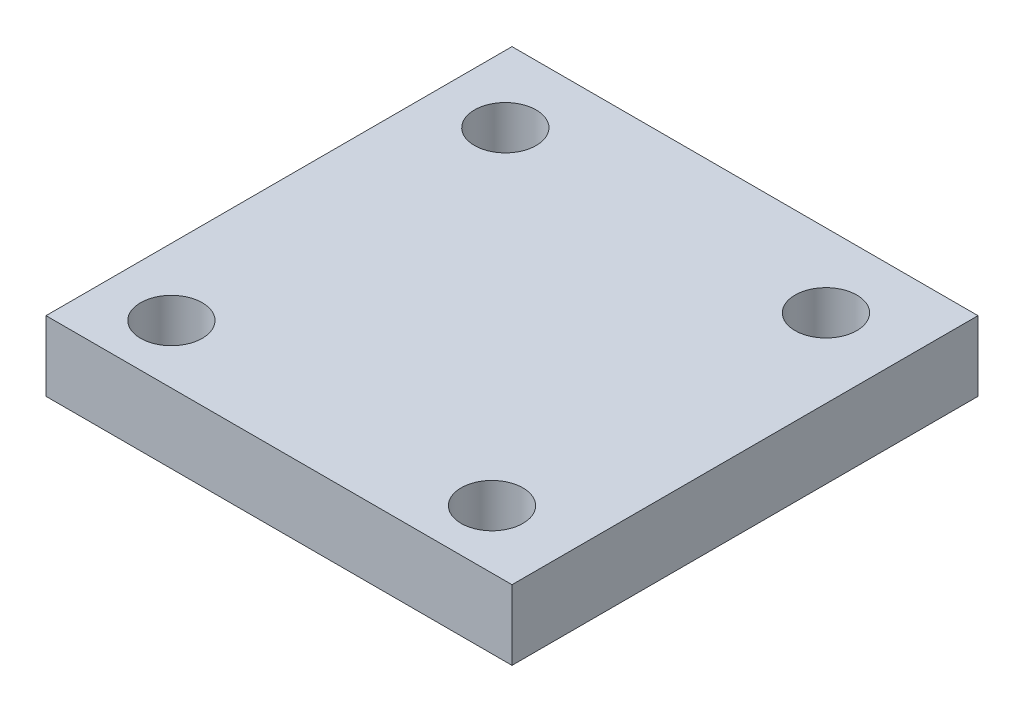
from build123d import *

# Parameters (mm, degrees)
SKETCH1_W              = 200
SKETCH1_H              = 200
EXTRUDE1_DEPTH         = 30
M30X3_5_TAPPED_HOLE1_D = 26.5


with BuildPart() as part:
    # Sketch1 → Extrude1 (new body)
    with BuildSketch(Plane(origin=(0, 0, 0), x_dir=(1, 0, 0), z_dir=(0, 1, 0))):
        Rectangle(SKETCH1_W, SKETCH1_H)
    extrude(amount=EXTRUDE1_DEPTH)

    # M30x3.5 Tapped Hole1 (through all)
    with Locations(Plane(origin=(0, 30, 0), x_dir=(-1, 0, 0), z_dir=(0, 1, 0))):
        with Locations((71.278825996, 74.899942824), (-66.323613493, 74.899942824), (-66.323613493, -68.420049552), (71.278825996, -68.420049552)):
            Hole(M30X3_5_TAPPED_HOLE1_D / 2)


solid = part.part
